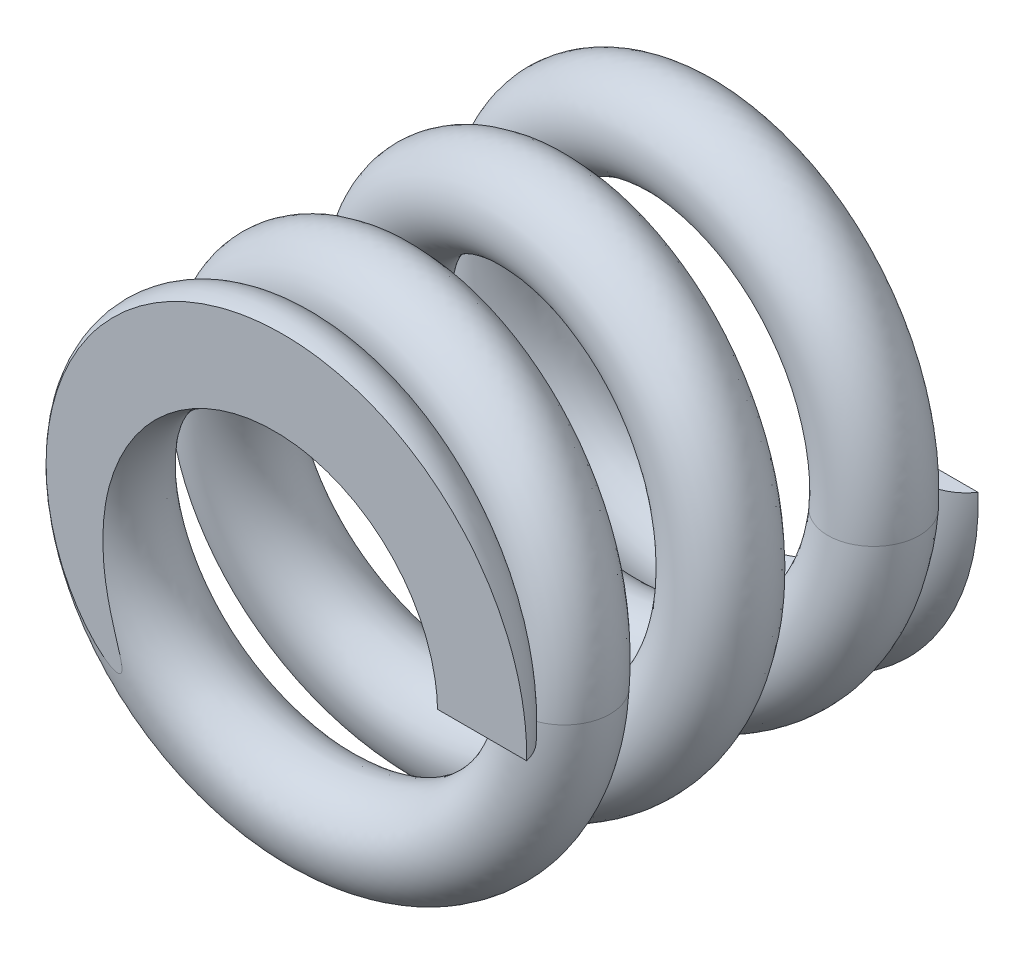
from build123d import *

# Parameters (mm, degrees)
SWEEP1_PITCH            = 3.429
SWEEP1_HEIGHT           = 6.858
SWEEP1_RADIUS           = 6.139392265
SKETCH2_R               = 1.016
SWEEP2_PITCH            = 2.0574
SWEEP2_HEIGHT           = 2.0574
SWEEP2_RADIUS           = 4.595774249
SWEEP2_START_ANGLE      = -180
SKETCH5_R               = 1.016
CUT_EXTRUDE3_DEPTH      = 12.062205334
CUT_EXTRUDE3_DEPTH_BACK = 12.062205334
SKETCH7_W               = 3.383437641
SKETCH7_H               = 15.693310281
SWEEP6_PITCH            = 2.0574
SWEEP6_HEIGHT           = 2.0574
SWEEP6_RADIUS           = 4.528827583
SKETCH8_R               = 1.016
CUT_EXTRUDE4_DEPTH      = 13.602393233
CUT_EXTRUDE4_DEPTH_BACK = 13.602393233
SKETCH26_W              = 20.950404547
SKETCH26_H              = 6.398027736


with BuildPart() as part:
    # Sweep1: sweep along a helix
    with BuildLine() as sweep1_path:
        Helix(SWEEP1_PITCH, SWEEP1_HEIGHT, SWEEP1_RADIUS, center=(0, 0, 0), direction=(0, 0, 1), lefthand=True)
    # Sketch2 → Sweep1 (sweep)
    with BuildSketch(Plane(origin=(0, 0, 0), x_dir=(1, 0, 0), z_dir=(0, 1, 0))):
        with Locations((4.510216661, 0.044935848)):
            Circle(SKETCH2_R)
    sweep(path=sweep1_path.line, is_frenet=True)

    # Sweep2: sweep along a helix
    with BuildLine() as sweep2_path:
        add(Helix(SWEEP2_PITCH, SWEEP2_HEIGHT, SWEEP2_RADIUS, center=(0, 0, 0), direction=(0, 0, -1), lefthand=True, mode=Mode.PRIVATE).rotate(Axis((0, 0, 0), (0, 0, -1)), SWEEP2_START_ANGLE))
    # Sketch5 → Sweep2 (sweep)
    with BuildSketch(Plane(origin=(0, 0, 0), x_dir=(1, 0, 0), z_dir=(0, 1, 0))):
        with Locations((4.510216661, 0.044935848)):
            Circle(SKETCH5_R)
    sweep(path=sweep2_path.line, is_frenet=True)

    # Sketch7 → Cut-Extrude3 (cut, two sides: drawn at the far end of the back side and taken through both)
    with BuildSketch(Plane(origin=(0, 0, 0), x_dir=(0, 0, -1), z_dir=(1, 0, 0)).offset(-CUT_EXTRUDE3_DEPTH_BACK)):
        with Locations((3.215718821, -0.493439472)):
            Rectangle(SKETCH7_W, SKETCH7_H)
    extrude(amount=CUT_EXTRUDE3_DEPTH + CUT_EXTRUDE3_DEPTH_BACK, mode=Mode.SUBTRACT)

    # Sweep6: sweep along a helix
    with BuildLine() as sweep6_path:
        Helix(SWEEP6_PITCH, SWEEP6_HEIGHT, SWEEP6_RADIUS, center=(0, 0, 6.858), direction=(0, 0, 1), lefthand=True)
    # Sketch8 → Sweep6 (sweep)
    with BuildSketch(Plane(origin=(0, 0, 0), x_dir=(-1, 0, 0), z_dir=(0, -1, 0))):
        with Locations((-4.510216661, -6.813064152)):
            Circle(SKETCH8_R)
    sweep(path=sweep6_path.line, is_frenet=True)

    # Sketch26 → Cut-Extrude4 (cut, two sides: drawn at the far end of the back side and taken through both)
    with BuildSketch(Plane(origin=(0, 0, 0), x_dir=(1, 0, 0), z_dir=(0, 1, 0)).offset(-CUT_EXTRUDE4_DEPTH_BACK)):
        with Locations((0.137996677, -11.835013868)):
            Rectangle(SKETCH26_W, SKETCH26_H)
    extrude(amount=CUT_EXTRUDE4_DEPTH + CUT_EXTRUDE4_DEPTH_BACK, mode=Mode.SUBTRACT)


solid = part.part
